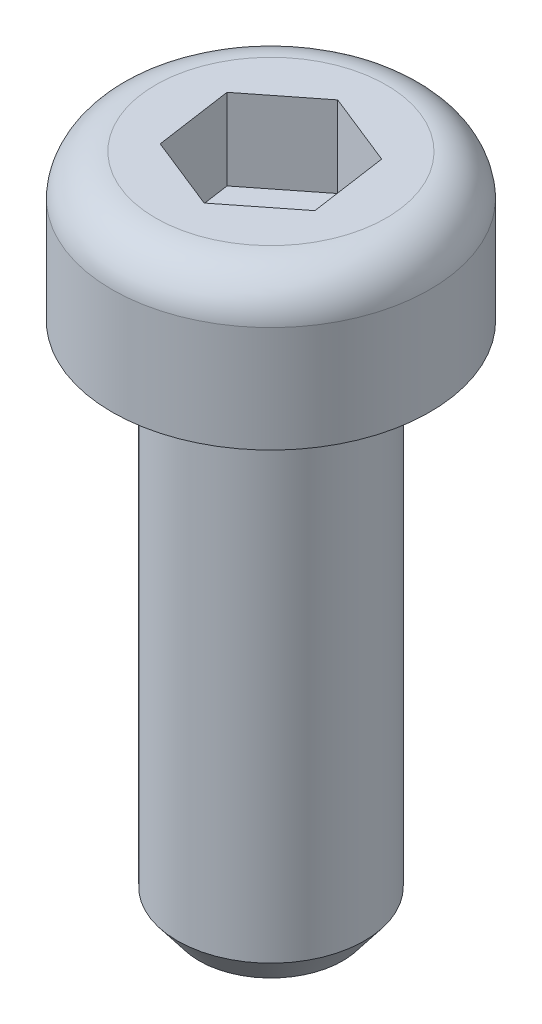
from build123d import *

# Parameters (mm, degrees)
SCHNITT_LINEAR_AUSTRAGEN1_DEPTH = 5


with BuildPart() as part:
    # Skizze1 → Rotation1 (revolve)
    with BuildSketch(Plane.XY, mode=Mode.PRIVATE) as rotation1_sk:
        with BuildLine():
            Line((0, -31.987383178), (0, 1.464650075))
            Line((0, 1.464650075), (-1.531738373, 1.464650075))
            Line((-1.531738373, 1.464650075), (-1.531738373, 9.019629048))
            Line((-1.531738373, 9.019629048), (-7.111977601, 9.019629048))
            ThreePointArc((-7.111977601, 9.019629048), (-8.939008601, 8.305289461), (-9.796994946, 6.541151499))
            Line((-9.796994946, 6.541151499), (-9.796994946, 0))
            Line((-9.796994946, 0), (-5.769468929, 0))
            Line((-5.769468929, 0), (-5.769468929, -30.246573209))
            Line((-5.769468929, -30.246573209), (-4.426960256, -31.987383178))
            Line((-4.426960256, -31.987383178), (0, -31.987383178))
        make_face()
    revolve(rotation1_sk.sketch.rotate(Axis((0, 0, 0), (0, -1, 0)), 270), axis=Axis((0, 0, 0), (0, -1, 0)))

    # Skizze2 → Schnitt-Linear austragen1 (cut)
    with BuildSketch(Plane(origin=(0, 9.019629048, 0), x_dir=(1, 0, 0), z_dir=(0, 1, 0))):
        Polygon((-0.693638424, 4.812231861), (-4.514334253, 1.805407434), (-3.820695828, -3.006824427), (0.693638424, -4.812231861), (4.514334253, -1.805407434), (3.820695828, 3.006824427), align=None)
    extrude(amount=-SCHNITT_LINEAR_AUSTRAGEN1_DEPTH, mode=Mode.SUBTRACT)


solid = part.part
